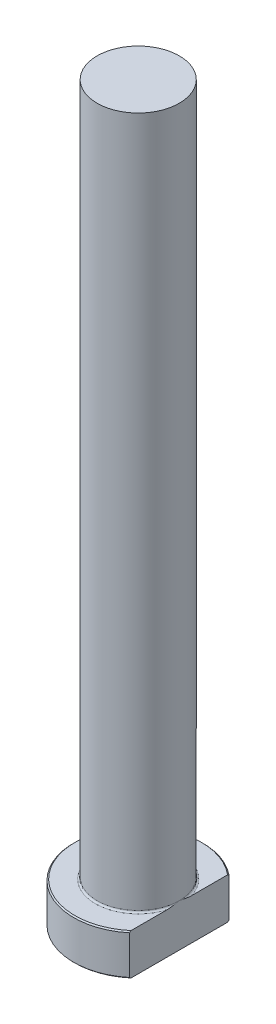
from build123d import *
from build123d.topology import SkipClean

# Parameters (mm, degrees)
CHAMFER1_SIZE = 0.2
FILLET1_R     = 0.3
KEY_DEPTH     = 126.964280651


with BuildPart() as part:
    # Sketch1 → Revolve1 (revolve)
    with BuildSketch(Plane.XY, mode=Mode.PRIVATE) as revolve1_sk:
        Polygon((0, 0), (-11, 0), (-11, 7), (-7, 7), (-7, 125), (0, 125), align=None)
    revolve(revolve1_sk.sketch.rotate(Axis((0, 259.958771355, 0), (0, -1, 0)), 270), axis=Axis((0, 259.958771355, 0), (0, -1, 0)))

    # Chamfer1
    chamfer1_edges = [part.edges().sort_by_distance(p)[0] for p in [
        (0, 7, -11),
        (0, 0, -11),
    ]]
    chamfer(chamfer1_edges, length=CHAMFER1_SIZE)

    # Fillet1
    fillet1_edges = [part.edges().sort_by_distance(p)[0] for p in [
        (0, 7, -7),
    ]]
    fillet(fillet1_edges, radius=FILLET1_R)

    # Sketch2 → KEY (cut, through all)
    with SkipClean():  # the faces are left unmerged after this step: merging them gives an invalid solid
        with BuildSketch(Plane(origin=(0, 0, 0), x_dir=(1, 0, 0), z_dir=(0, 1, 0))):
            with BuildLine():
                Line((7, 8.485281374), (7, -8.485281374))
                ThreePointArc((7, -8.485281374), (11, 0), (7, 8.485281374))
            make_face()
        extrude(amount=KEY_DEPTH, mode=Mode.SUBTRACT)


solid = part.part
